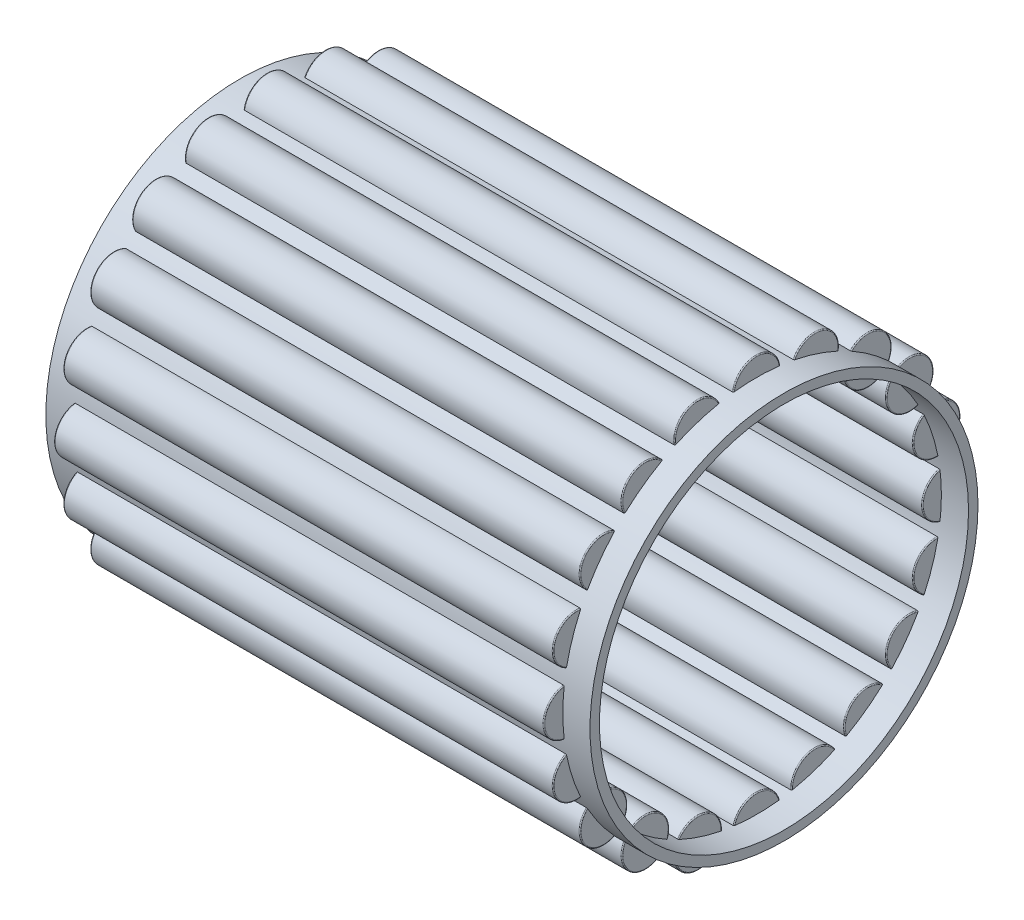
from build123d import *

# Parameters (mm, degrees)
CAGSPISKE_W           = 23
CAGSPISKE_H           = 0.4
ROLLERSDETAILED_COUNT = 20
ROLLERSDETAILED_ANGLE = 342


with BuildPart() as part:
    # CagSpiSke → CageSpine (revolve)
    with BuildSketch(Plane.XY, mode=Mode.PRIVATE) as cagespine_sk:
        with Locations((0, 8)):
            Rectangle(CAGSPISKE_W, CAGSPISKE_H)
    revolve(cagespine_sk.sketch.rotate(Axis((-12.7, 0, 0), (1, 0, 0)), 270), axis=Axis((-12.7, 0, 0), (1, 0, 0)))

    # RolDetSke → RollerDetailed (revolve)
    with BuildSketch(Plane.XY):
        with BuildLine():
            Line((-10.31, 9), (10.31, 9))
            ThreePointArc((10.31, 9), (10.338284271, 8.988284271), (10.35, 8.96))
            Line((10.35, 8.96), (10.35, 8))
            Line((10.35, 8), (-10.35, 8))
            Line((-10.35, 8), (-10.35, 8.96))
            ThreePointArc((-10.35, 8.96), (-10.338284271, 8.988284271), (-10.31, 9))
        make_face()
    rollerdetailed = revolve(axis=Axis((-17.78, 8, 0), (1, 0, 0)))

    # RollersDetailed: RollerDetailed ×20 about axis
    rollersdetailed_axis = Axis((-50, 0, 0), (1, 0, 0))
    for i in range(1, ROLLERSDETAILED_COUNT):
        add(rollerdetailed.rotate(rollersdetailed_axis, i * ROLLERSDETAILED_ANGLE / (ROLLERSDETAILED_COUNT - 1)))


solid = part.part
